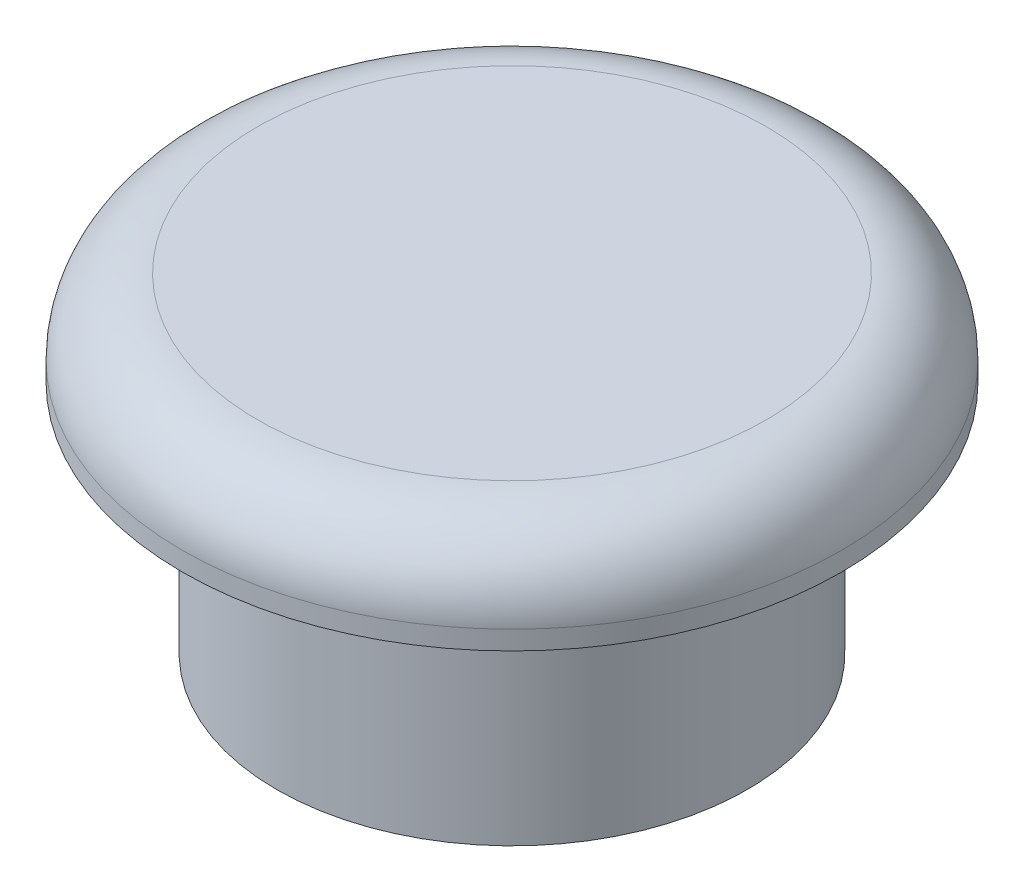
from build123d import *

# Parameters (mm, degrees)
CONG_2_R = 0.8


with BuildPart() as part:
    # Esquisse1 → R_volution1 (revolve)
    with BuildSketch(Plane.XY, mode=Mode.PRIVATE) as r_volution1_sk:
        Polygon((2.5, 0), (2.5, 2.5), (3.5, 2.5), (3.5, 3.5), (0, 3.5), (0, 2.5), (1.5, 2.5), (1.5, 0), align=None)
    revolve(r_volution1_sk.sketch.rotate(Axis((0, 22.404093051, 0), (0, -1, 0)), 90), axis=Axis((0, 22.404093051, 0), (0, -1, 0)))

    # Cong_2
    cong_2_edges = [part.edges().sort_by_distance(p)[0] for p in [
        (0, 3.5, -3.5),
    ]]
    fillet(cong_2_edges, radius=CONG_2_R)


solid = part.part
